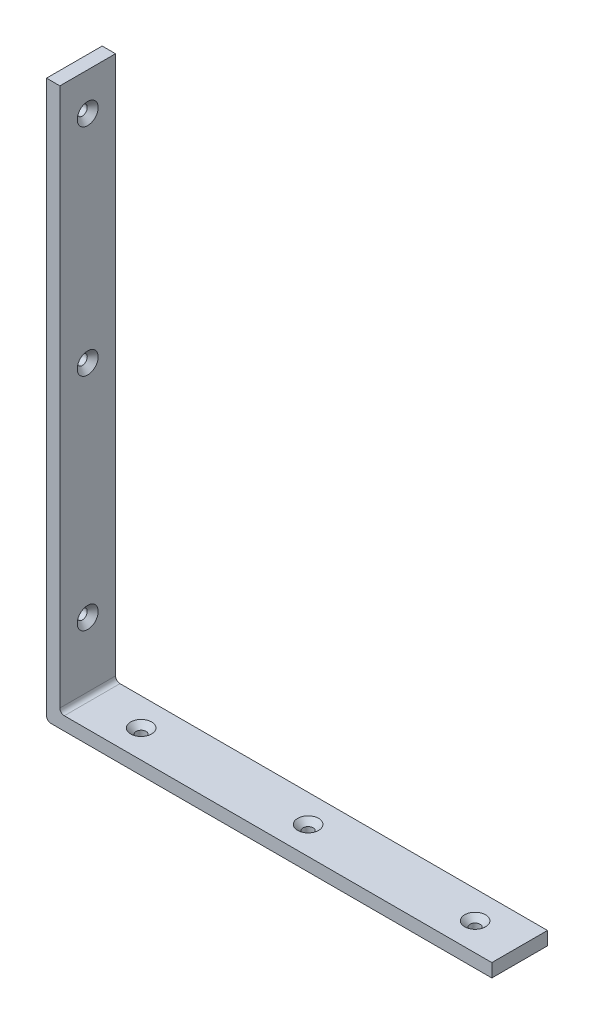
from build123d import *

# Parameters (mm, degrees)
BOSS_EXTRUDE1_DEPTH                             = 25
FILLET1_R                                       = 2
FILLET2_R                                       = 2
CSK_FOR_M4_FLAT_HEAD_MACHINE_SCREW1_D           = 4.5
CSK_FOR_M4_FLAT_HEAD_MACHINE_SCREW1_CSINK_D     = 9.4
CSK_FOR_M4_FLAT_HEAD_MACHINE_SCREW1_CSINK_ANGLE = 90
CSK_FOR_M4_FLAT_HEAD_MACHINE_SCREW2_D           = 4.5
CSK_FOR_M4_FLAT_HEAD_MACHINE_SCREW2_CSINK_D     = 9.4
CSK_FOR_M4_FLAT_HEAD_MACHINE_SCREW2_CSINK_ANGLE = 90


with BuildPart() as part:
    # Sketch1 → Boss-Extrude1 (new body)
    with BuildSketch(Plane.XY):
        Polygon((-94, 125), (-94, -119), (100, -119), (100, -125), (-100, -125), (-100, 125), align=None)
    extrude(amount=BOSS_EXTRUDE1_DEPTH)

    # Fillet1
    fillet1_edges = [part.edges().sort_by_distance(p)[0] for p in [
        (-94, -119, 12.5),
    ]]
    fillet(fillet1_edges, radius=FILLET1_R)

    # Fillet2
    fillet2_edges = [part.edges().sort_by_distance(p)[0] for p in [
        (-100, -125, 12.5),
    ]]
    fillet(fillet2_edges, radius=FILLET2_R)

    # CSK for M4 Flat Head Machine Screw1 (through all)
    with Locations(Plane(origin=(0, -119, 0), x_dir=(1, 0, 0), z_dir=(0, 1, 0))):
        with Locations((-70, -12.5), (5, -12.5), (80, -12.5)):
            CounterSinkHole(CSK_FOR_M4_FLAT_HEAD_MACHINE_SCREW1_D / 2, CSK_FOR_M4_FLAT_HEAD_MACHINE_SCREW1_CSINK_D / 2, counter_sink_angle=CSK_FOR_M4_FLAT_HEAD_MACHINE_SCREW1_CSINK_ANGLE)

    # CSK for M4 Flat Head Machine Screw2 (through all)
    with Locations(Plane(origin=(-94, 0, 0), x_dir=(0, 0, -1), z_dir=(1, 0, 0))):
        with Locations((-12.5, -88), (-12.5, 11), (-12.5, 108)):
            CounterSinkHole(CSK_FOR_M4_FLAT_HEAD_MACHINE_SCREW2_D / 2, CSK_FOR_M4_FLAT_HEAD_MACHINE_SCREW2_CSINK_D / 2, counter_sink_angle=CSK_FOR_M4_FLAT_HEAD_MACHINE_SCREW2_CSINK_ANGLE)


solid = part.part
